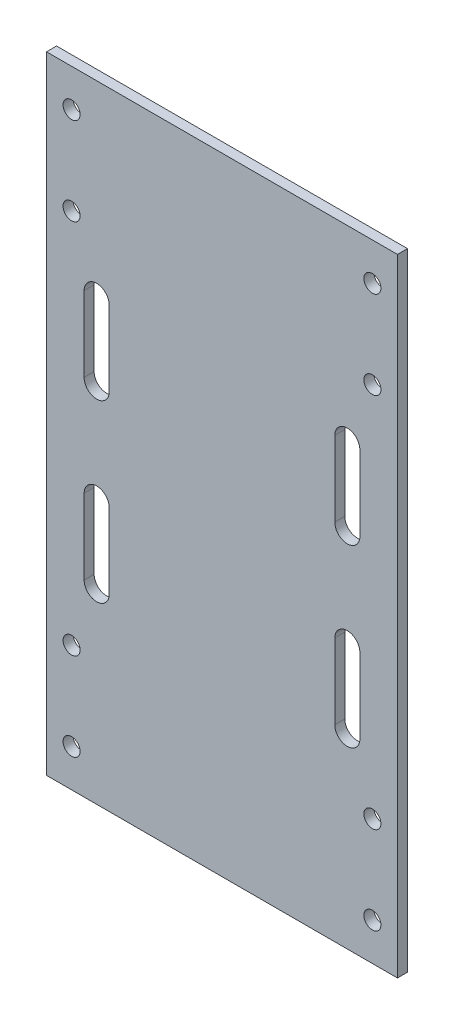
from build123d import *

# Parameters (mm, degrees)
SKETCH1_W                   = 70
SKETCH1_H                   = 125
BOSS_EXTRUDE1_DEPTH         = 2
LO_XUYEN_M3_D3_4_DEPTH      = 72.660658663
LO_XUYEN_M3_D3_4_DEPTH_BACK = 72.660658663
SKETCH2_R                   = 1.7
THAN_RANH_DEPTH             = 72.660658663
THAN_RANH_DEPTH_BACK        = 72.660658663
SKETCH3_W                   = 5
SKETCH3_H                   = 15
DAU_RANH_R2_5_DEPTH         = 72.660658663
DAU_RANH_R2_5_DEPTH_BACK    = 72.660658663
SKETCH4_R                   = 2.5


with BuildPart() as part:
    # Sketch1 → Boss-Extrude1 (new body)
    with BuildSketch(Plane.XY):
        Rectangle(SKETCH1_W, SKETCH1_H)
    extrude(amount=-BOSS_EXTRUDE1_DEPTH)

    # Sketch2 → Lo_xuyen_M3_D3_4 (cut, two sides: drawn at the far end of the back side and taken through both)
    with BuildSketch(Plane.XY.offset(-LO_XUYEN_M3_D3_4_DEPTH_BACK)):
        with Locations((-30, -55)):
            Circle(SKETCH2_R)
        with Locations((-30, -37.5)):
            Circle(SKETCH2_R)
        with Locations((-30, 37.5)):
            Circle(SKETCH2_R)
        with Locations((-30, 55)):
            Circle(SKETCH2_R)
        with Locations((30, -55)):
            Circle(SKETCH2_R)
        with Locations((30, -37.5)):
            Circle(SKETCH2_R)
        with Locations((30, 37.5)):
            Circle(SKETCH2_R)
        with Locations((30, 55)):
            Circle(SKETCH2_R)
    extrude(amount=LO_XUYEN_M3_D3_4_DEPTH + LO_XUYEN_M3_D3_4_DEPTH_BACK, mode=Mode.SUBTRACT)

    # Sketch3 → Than_ranh (cut, two sides: drawn at the far end of the back side and taken through both)
    with BuildSketch(Plane.XY.offset(-THAN_RANH_DEPTH_BACK)):
        with Locations((-25, -17.5)):
            Rectangle(SKETCH3_W, SKETCH3_H)
        with Locations((-25, 17.5)):
            Rectangle(SKETCH3_W, SKETCH3_H)
        with Locations((25, -17.5)):
            Rectangle(SKETCH3_W, SKETCH3_H)
        with Locations((25, 17.5)):
            Rectangle(SKETCH3_W, SKETCH3_H)
    extrude(amount=THAN_RANH_DEPTH + THAN_RANH_DEPTH_BACK, mode=Mode.SUBTRACT)

    # Sketch4 → Dau_ranh_R2_5 (cut, two sides: drawn at the far end of the back side and taken through both)
    with BuildSketch(Plane.XY.offset(-DAU_RANH_R2_5_DEPTH_BACK)):
        with Locations((-25, -25)):
            Circle(SKETCH4_R)
        with Locations((-25, -10)):
            Circle(SKETCH4_R)
        with Locations((-25, 10)):
            Circle(SKETCH4_R)
        with Locations((-25, 25)):
            Circle(SKETCH4_R)
        with Locations((25, -25)):
            Circle(SKETCH4_R)
        with Locations((25, -10)):
            Circle(SKETCH4_R)
        with Locations((25, 10)):
            Circle(SKETCH4_R)
        with Locations((25, 25)):
            Circle(SKETCH4_R)
    extrude(amount=DAU_RANH_R2_5_DEPTH + DAU_RANH_R2_5_DEPTH_BACK, mode=Mode.SUBTRACT)


solid = part.part
